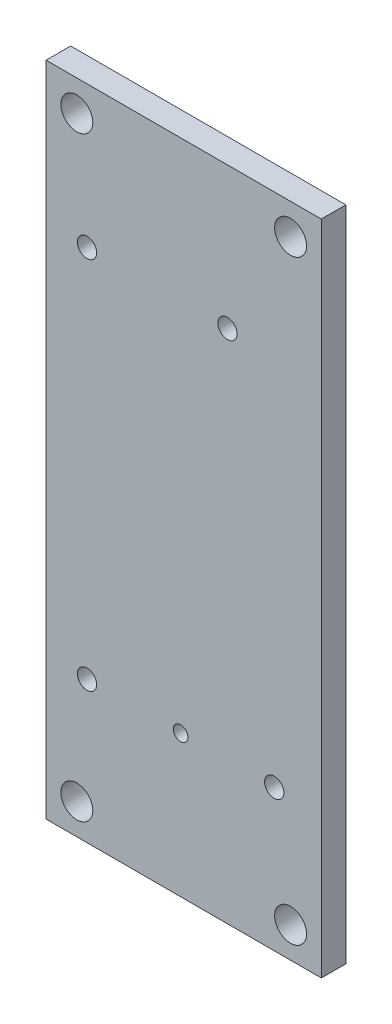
from build123d import *

# Parameters (mm, degrees)
SKETCH1_W              = 22.399999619
SKETCH1_H              = 53.5
SKETCH1_R              = 0.785000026
SKETCH1_R_2            = 0.597890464
BOSS_EXTRUDE1_DEPTH    = 2
M2_5_CLEARANCE_HOLE1_D = 2.6


with BuildPart() as part:
    # Sketch1 → Boss-Extrude1 (new body)
    with BuildSketch(Plane(origin=(0, 0, 13.562428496), x_dir=(-1, 0, 0), z_dir=(0, 0, -1))):
        with Locations((55.613096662, 10.996865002)):
            Rectangle(SKETCH1_W, SKETCH1_H)
        with Locations((52.055602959, 26.216866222)):
            Circle(SKETCH1_R, mode=Mode.SUBTRACT)
        with Locations((63.485603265, 26.216866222)):
            Circle(SKETCH1_R, mode=Mode.SUBTRACT)
        with Locations((48.245603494, -4.223135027)):
            Circle(SKETCH1_R, mode=Mode.SUBTRACT)
        with Locations((63.485603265, -4.223135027)):
            Circle(SKETCH1_R, mode=Mode.SUBTRACT)
        with Locations((55.865603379, -4.223135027)):
            Circle(SKETCH1_R_2, mode=Mode.SUBTRACT)
    extrude(amount=BOSS_EXTRUDE1_DEPTH)

    # M2.5 Clearance Hole1 (through all)
    with Locations(Plane.XY.offset(13.562428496)):
        with Locations((-64.313096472, 35.246865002), (-46.913096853, 35.246865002), (-46.913096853, -13.253134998), (-64.313096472, -13.253134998)):
            Hole(M2_5_CLEARANCE_HOLE1_D / 2)


solid = part.part
